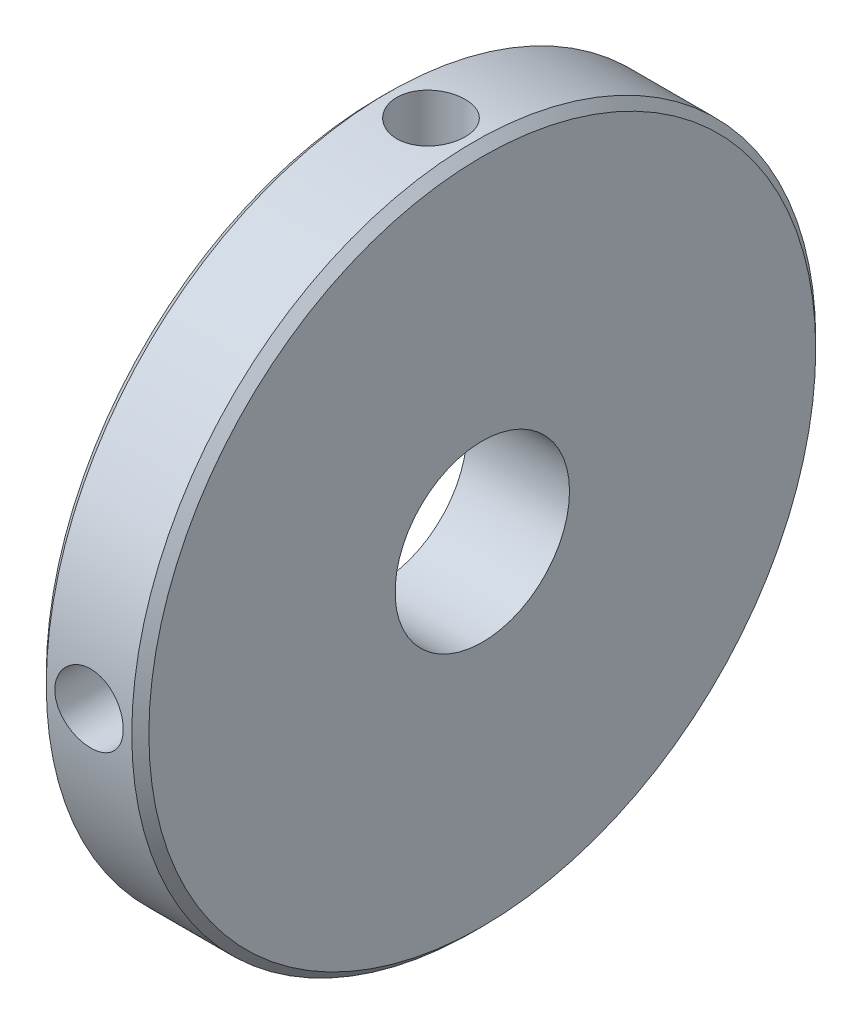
ISO-10303-21;
HEADER;
FILE_DESCRIPTION(('STEP AP214'),'2;1');
FILE_NAME('part.step','',(''),(''),'','','');
FILE_SCHEMA(('AUTOMOTIVE_DESIGN { 1 0 10303 214 1 1 1 1 }'));
ENDSEC;
DATA;
#1=APPLICATION_CONTEXT('core data for automotive mechanical design processes');
#2=APPLICATION_PROTOCOL_DEFINITION('international standard','automotive_design',2000,#1);
#3=PRODUCT_CONTEXT('',#1,'mechanical');
#4=PRODUCT('Part','Part','',(#3));
#5=PRODUCT_RELATED_PRODUCT_CATEGORY('part','',(#4));
#6=PRODUCT_DEFINITION_FORMATION('','',#4);
#7=PRODUCT_DEFINITION_CONTEXT('part definition',#1,'design');
#8=PRODUCT_DEFINITION('design','',#6,#7);
#9=PRODUCT_DEFINITION_SHAPE('','',#8);
#10=(LENGTH_UNIT() NAMED_UNIT(*) SI_UNIT(.MILLI.,.METRE.));
#11=(NAMED_UNIT(*) PLANE_ANGLE_UNIT() SI_UNIT($,.RADIAN.));
#12=(NAMED_UNIT(*) SI_UNIT($,.STERADIAN.) SOLID_ANGLE_UNIT());
#13=UNCERTAINTY_MEASURE_WITH_UNIT(LENGTH_MEASURE(1.E-05),#10,'distance_accuracy_value','');
#14=(GEOMETRIC_REPRESENTATION_CONTEXT(3) GLOBAL_UNCERTAINTY_ASSIGNED_CONTEXT((#13)) GLOBAL_UNIT_ASSIGNED_CONTEXT((#10,
#11,#12)) REPRESENTATION_CONTEXT('',''));
#15=CARTESIAN_POINT('',(0.,0.,0.));
#16=DIRECTION('',(0.,0.,1.));
#17=DIRECTION('',(1.,0.,0.));
#18=AXIS2_PLACEMENT_3D('',#15,#16,#17);
#19=CARTESIAN_POINT('',(-6.22145748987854,0.,0.));
#20=DIRECTION('',(-1.,0.,0.));
#21=DIRECTION('',(0.,0.,1.));
#22=AXIS2_PLACEMENT_3D('',#19,#20,#21);
#23=CYLINDRICAL_SURFACE('',#22,20.);
#24=CARTESIAN_POINT('',(5.5,0.,0.));
#25=DIRECTION('',(-1.,0.,0.));
#26=DIRECTION('',(0.,0.,1.));
#27=AXIS2_PLACEMENT_3D('',#24,#25,#26);
#28=CIRCLE('',#27,20.);
#29=CARTESIAN_POINT('',(5.5,0.,20.));
#30=VERTEX_POINT('',#29);
#31=EDGE_CURVE('E138',#30,#30,#28,.T.);
#32=ORIENTED_EDGE('',*,*,#31,.T.);
#33=EDGE_LOOP('',(#32));
#34=FACE_BOUND('',#33,.T.);
#35=CARTESIAN_POINT('',(0.500000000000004,0.,0.));
#36=DIRECTION('',(1.,0.,0.));
#37=DIRECTION('',(0.,0.,-1.));
#38=AXIS2_PLACEMENT_3D('',#35,#36,#37);
#39=CIRCLE('',#38,20.);
#40=CARTESIAN_POINT('',(0.500000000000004,0.,-20.));
#41=VERTEX_POINT('',#40);
#42=EDGE_CURVE('E139',#41,#41,#39,.T.);
#43=ORIENTED_EDGE('',*,*,#42,.T.);
#44=EDGE_LOOP('',(#43));
#45=FACE_BOUND('',#44,.T.);
#46=CARTESIAN_POINT('',(1.,20.,0.));
#47=CARTESIAN_POINT('',(1.00000485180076,19.9999987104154,0.112040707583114));
#48=CARTESIAN_POINT('',(1.00944653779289,19.9990485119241,0.224155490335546));
#49=CARTESIAN_POINT('',(1.04696874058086,19.9953493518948,0.445276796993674));
#50=CARTESIAN_POINT('',(1.07506979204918,19.9925984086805,0.554279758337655));
#51=CARTESIAN_POINT('',(1.14908448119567,19.9856082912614,0.765943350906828));
#52=CARTESIAN_POINT('',(1.19498736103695,19.9813700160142,0.868607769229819));
#53=CARTESIAN_POINT('',(1.30328181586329,19.9718791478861,1.06475232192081));
#54=CARTESIAN_POINT('',(1.36567011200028,19.9666267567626,1.15823427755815));
#55=CARTESIAN_POINT('',(1.50540539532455,19.9556748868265,1.33371910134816));
#56=CARTESIAN_POINT('',(1.58279959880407,19.9499740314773,1.41568428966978));
#57=CARTESIAN_POINT('',(1.75024906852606,19.9387791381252,1.56548504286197));
#58=CARTESIAN_POINT('',(1.84030492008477,19.9332851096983,1.6333199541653));
#59=CARTESIAN_POINT('',(2.03075706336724,19.9231118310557,1.75306794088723));
#60=CARTESIAN_POINT('',(2.13117488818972,19.9184343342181,1.80494693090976));
#61=CARTESIAN_POINT('',(2.33935117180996,19.9104407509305,1.89109276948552));
#62=CARTESIAN_POINT('',(2.4471094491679,19.9071246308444,1.92536005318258));
#63=CARTESIAN_POINT('',(2.66652360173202,19.9022416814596,1.97519808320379));
#64=CARTESIAN_POINT('',(2.77816515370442,19.9006690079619,1.99083130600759));
#65=CARTESIAN_POINT('',(3.00249772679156,19.8994328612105,2.00315057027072));
#66=CARTESIAN_POINT('',(3.11518872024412,19.8997693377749,1.9998371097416));
#67=CARTESIAN_POINT('',(3.33799061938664,19.9023081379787,1.97440856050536));
#68=CARTESIAN_POINT('',(3.44810939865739,19.904503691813,1.9523616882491));
#69=CARTESIAN_POINT('',(3.66307592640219,19.9105026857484,1.89019828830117));
#70=CARTESIAN_POINT('',(3.76792360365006,19.9143061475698,1.85008151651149));
#71=CARTESIAN_POINT('',(3.96958717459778,19.9231001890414,1.75284178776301));
#72=CARTESIAN_POINT('',(4.06638837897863,19.9280928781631,1.69568856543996));
#73=CARTESIAN_POINT('',(4.24905042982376,19.9387010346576,1.56602005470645));
#74=CARTESIAN_POINT('',(4.33491095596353,19.9443165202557,1.49350431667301));
#75=CARTESIAN_POINT('',(4.49365078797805,19.9555677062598,1.33478822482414));
#76=CARTESIAN_POINT('',(4.56647120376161,19.9612033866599,1.24852895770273));
#77=CARTESIAN_POINT('',(4.69660726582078,19.9718365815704,1.06497896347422));
#78=CARTESIAN_POINT('',(4.75392289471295,19.9768340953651,0.967688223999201));
#79=CARTESIAN_POINT('',(4.8514200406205,19.9856295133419,0.764796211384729));
#80=CARTESIAN_POINT('',(4.89159856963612,19.9894272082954,0.659193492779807));
#81=CARTESIAN_POINT('',(4.9536378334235,19.9953929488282,0.442694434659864));
#82=CARTESIAN_POINT('',(4.97549911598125,19.9975610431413,0.331798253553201));
#83=CARTESIAN_POINT('',(5.00020861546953,20.0000170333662,0.108370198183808));
#84=CARTESIAN_POINT('',(5.003138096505,20.0003129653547,-0.00415260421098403));
#85=CARTESIAN_POINT('',(4.99011427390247,19.9990128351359,-0.228087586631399));
#86=CARTESIAN_POINT('',(4.97416122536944,19.9974167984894,-0.33949978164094));
#87=CARTESIAN_POINT('',(4.92389260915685,19.9925172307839,-0.557816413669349));
#88=CARTESIAN_POINT('',(4.88961509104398,19.9892172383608,-0.664729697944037));
#89=CARTESIAN_POINT('',(4.80370965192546,19.9812799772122,-0.871288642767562));
#90=CARTESIAN_POINT('',(4.7520813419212,19.9766426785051,-0.970934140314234));
#91=CARTESIAN_POINT('',(4.63273832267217,19.9665295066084,-1.16049636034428));
#92=CARTESIAN_POINT('',(4.56497022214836,19.9610508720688,-1.25037931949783));
#93=CARTESIAN_POINT('',(4.41534786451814,19.9498786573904,-1.41752324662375));
#94=CARTESIAN_POINT('',(4.33349325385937,19.9441850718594,-1.49478389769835));
#95=CARTESIAN_POINT('',(4.157666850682,19.9332004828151,-1.63477221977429));
#96=CARTESIAN_POINT('',(4.06365248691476,19.9279110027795,-1.69744655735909));
#97=CARTESIAN_POINT('',(3.86638527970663,19.9183566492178,-1.80611651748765));
#98=CARTESIAN_POINT('',(3.76313256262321,19.9140917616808,-1.85211236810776));
#99=CARTESIAN_POINT('',(3.55050252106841,19.907078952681,-1.92603041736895));
#100=CARTESIAN_POINT('',(3.44113631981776,19.9043283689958,-1.95398434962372));
#101=CARTESIAN_POINT('',(3.21923360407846,19.9006473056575,-1.99112801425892));
#102=CARTESIAN_POINT('',(3.10669718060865,19.8997167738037,-2.00031828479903));
#103=CARTESIAN_POINT('',(2.88217862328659,19.8997822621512,-1.99966627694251));
#104=CARTESIAN_POINT('',(2.77019623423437,19.9007698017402,-1.98990777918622));
#105=CARTESIAN_POINT('',(2.54947016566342,19.9045420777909,-1.9518109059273));
#106=CARTESIAN_POINT('',(2.44072648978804,19.9073268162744,-1.92347250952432));
#107=CARTESIAN_POINT('',(2.22956530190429,19.9143773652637,-1.84904337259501));
#108=CARTESIAN_POINT('',(2.12714691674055,19.9186429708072,-1.80295508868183));
#109=CARTESIAN_POINT('',(1.93148621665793,19.9281750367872,-1.69434310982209));
#110=CARTESIAN_POINT('',(1.83824385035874,19.933441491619,-1.63181950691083));
#111=CARTESIAN_POINT('',(1.66315265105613,19.944409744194,-1.49179711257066));
#112=CARTESIAN_POINT('',(1.58135384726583,19.950113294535,-1.41423589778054));
#113=CARTESIAN_POINT('',(1.43189553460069,19.9612970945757,-1.24646339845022));
#114=CARTESIAN_POINT('',(1.36423941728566,19.9667772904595,-1.15624908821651));
#115=CARTESIAN_POINT('',(1.24485309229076,19.9769112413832,-0.965482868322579));
#116=CARTESIAN_POINT('',(1.19316341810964,19.9815628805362,-0.864905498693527));
#117=CARTESIAN_POINT('',(1.10747515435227,19.9894925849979,-0.656516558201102));
#118=CARTESIAN_POINT('',(1.07345661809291,19.9927721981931,-0.548713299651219));
#119=CARTESIAN_POINT('',(1.0325587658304,19.9967642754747,-0.366916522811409));
#120=CARTESIAN_POINT('',(1.02036591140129,19.9979720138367,-0.294085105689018));
#121=CARTESIAN_POINT('',(1.00408494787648,19.9995902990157,-0.147513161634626));
#122=CARTESIAN_POINT('',(0.999996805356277,20.0000008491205,-0.0737726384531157));
#123=CARTESIAN_POINT('',(1.,20.,0.));
#124=B_SPLINE_CURVE_WITH_KNOTS('',3,(#46,#47,#48,#49,#50,#51,#52,#53,#54,#55,#56,#57,#58,#59,
#60,#61,#62,#63,#64,#65,#66,#67,#68,#69,#70,#71,#72,#73,#74,#75,#76,#77,#78,#79,#80,#81,#82,#83,
#84,#85,#86,#87,#88,#89,#90,#91,#92,#93,#94,#95,#96,#97,#98,#99,#100,#101,#102,#103,#104,#105,
#106,#107,#108,#109,#110,#111,#112,#113,#114,#115,#116,#117,#118,#119,#120,#121,#122,#123),
.UNSPECIFIED.,.T.,.F.,(4,2,2,2,2,2,2,2,2,2,2,2,2,2,2,2,2,2,2,2,2,2,2,2,2,2,2,2,2,2,2,2,2,2,2,2,
2,2,4),(0.,0.335852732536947,0.672075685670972,1.0080957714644,1.34404907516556,
1.68107713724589,2.01812078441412,2.35587950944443,2.69362988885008,3.03024464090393,
3.36685054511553,3.70223594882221,4.03762588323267,4.37361522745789,4.7096144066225,
5.04709468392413,5.38457533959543,5.72211481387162,6.05964419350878,6.39572377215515,
6.73179881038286,7.06717870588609,7.40256612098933,7.73907881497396,8.07559995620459,
8.41333287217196,8.75106116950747,9.08819381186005,9.4253167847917,9.76095258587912,
10.0965887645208,10.432178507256,10.7677663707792,11.1047783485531,11.4418710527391,
11.7798126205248,12.1173718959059,12.338513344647,12.5596538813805),.UNSPECIFIED.);
#125=CARTESIAN_POINT('',(1.,20.,0.));
#126=VERTEX_POINT('',#125);
#127=EDGE_CURVE('E86',#126,#126,#124,.T.);
#128=ORIENTED_EDGE('',*,*,#127,.F.);
#129=EDGE_LOOP('',(#128));
#130=FACE_BOUND('',#129,.T.);
#131=CARTESIAN_POINT('',(1.,0.,-20.));
#132=CARTESIAN_POINT('',(1.00000485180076,0.112040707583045,-19.9999987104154));
#133=CARTESIAN_POINT('',(1.00944653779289,0.224155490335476,-19.9990485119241));
#134=CARTESIAN_POINT('',(1.04696874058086,0.445276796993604,-19.9953493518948));
#135=CARTESIAN_POINT('',(1.07506979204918,0.554279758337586,-19.9925984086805));
#136=CARTESIAN_POINT('',(1.14908448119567,0.765943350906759,-19.9856082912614));
#137=CARTESIAN_POINT('',(1.19498736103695,0.868607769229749,-19.9813700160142));
#138=CARTESIAN_POINT('',(1.30328181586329,1.06475232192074,-19.9718791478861));
#139=CARTESIAN_POINT('',(1.36567011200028,1.15823427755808,-19.9666267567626));
#140=CARTESIAN_POINT('',(1.50540539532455,1.33371910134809,-19.9556748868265));
#141=CARTESIAN_POINT('',(1.58279959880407,1.41568428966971,-19.9499740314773));
#142=CARTESIAN_POINT('',(1.75024906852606,1.5654850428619,-19.9387791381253));
#143=CARTESIAN_POINT('',(1.84030492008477,1.63331995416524,-19.9332851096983));
#144=CARTESIAN_POINT('',(2.03075706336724,1.75306794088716,-19.9231118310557));
#145=CARTESIAN_POINT('',(2.13117488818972,1.80494693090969,-19.9184343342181));
#146=CARTESIAN_POINT('',(2.33935117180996,1.89109276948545,-19.9104407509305));
#147=CARTESIAN_POINT('',(2.4471094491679,1.92536005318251,-19.9071246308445));
#148=CARTESIAN_POINT('',(2.66652360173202,1.97519808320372,-19.9022416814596));
#149=CARTESIAN_POINT('',(2.77816515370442,1.99083130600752,-19.9006690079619));
#150=CARTESIAN_POINT('',(3.00249772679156,2.00315057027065,-19.8994328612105));
#151=CARTESIAN_POINT('',(3.11518872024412,1.99983710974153,-19.8997693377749));
#152=CARTESIAN_POINT('',(3.33799061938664,1.97440856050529,-19.9023081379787));
#153=CARTESIAN_POINT('',(3.44810939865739,1.95236168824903,-19.904503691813));
#154=CARTESIAN_POINT('',(3.66307592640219,1.8901982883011,-19.9105026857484));
#155=CARTESIAN_POINT('',(3.76792360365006,1.85008151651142,-19.9143061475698));
#156=CARTESIAN_POINT('',(3.96958717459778,1.75284178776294,-19.9231001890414));
#157=CARTESIAN_POINT('',(4.06638837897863,1.69568856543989,-19.9280928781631));
#158=CARTESIAN_POINT('',(4.24905042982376,1.56602005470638,-19.9387010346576));
#159=CARTESIAN_POINT('',(4.33491095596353,1.49350431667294,-19.9443165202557));
#160=CARTESIAN_POINT('',(4.49365078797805,1.33478822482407,-19.9555677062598));
#161=CARTESIAN_POINT('',(4.56647120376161,1.24852895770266,-19.96120338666));
#162=CARTESIAN_POINT('',(4.69660726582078,1.06497896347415,-19.9718365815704));
#163=CARTESIAN_POINT('',(4.75392289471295,0.967688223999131,-19.9768340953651));
#164=CARTESIAN_POINT('',(4.8514200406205,0.764796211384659,-19.9856295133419));
#165=CARTESIAN_POINT('',(4.89159856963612,0.659193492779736,-19.9894272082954));
#166=CARTESIAN_POINT('',(4.9536378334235,0.442694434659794,-19.9953929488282));
#167=CARTESIAN_POINT('',(4.97549911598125,0.33179825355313,-19.9975610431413));
#168=CARTESIAN_POINT('',(5.00020861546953,0.108370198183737,-20.0000170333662));
#169=CARTESIAN_POINT('',(5.003138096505,-0.00415260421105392,-20.0003129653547));
#170=CARTESIAN_POINT('',(4.99011427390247,-0.228087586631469,-19.9990128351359));
#171=CARTESIAN_POINT('',(4.97416122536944,-0.33949978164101,-19.9974167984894));
#172=CARTESIAN_POINT('',(4.92389260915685,-0.557816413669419,-19.9925172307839));
#173=CARTESIAN_POINT('',(4.88961509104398,-0.664729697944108,-19.9892172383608));
#174=CARTESIAN_POINT('',(4.80370965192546,-0.871288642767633,-19.9812799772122));
#175=CARTESIAN_POINT('',(4.7520813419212,-0.970934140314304,-19.9766426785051));
#176=CARTESIAN_POINT('',(4.63273832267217,-1.16049636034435,-19.9665295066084));
#177=CARTESIAN_POINT('',(4.56497022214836,-1.2503793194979,-19.9610508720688));
#178=CARTESIAN_POINT('',(4.41534786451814,-1.41752324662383,-19.9498786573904));
#179=CARTESIAN_POINT('',(4.33349325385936,-1.49478389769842,-19.9441850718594));
#180=CARTESIAN_POINT('',(4.157666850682,-1.63477221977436,-19.9332004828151));
#181=CARTESIAN_POINT('',(4.06365248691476,-1.69744655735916,-19.9279110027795));
#182=CARTESIAN_POINT('',(3.86638527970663,-1.80611651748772,-19.9183566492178));
#183=CARTESIAN_POINT('',(3.76313256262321,-1.85211236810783,-19.9140917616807));
#184=CARTESIAN_POINT('',(3.55050252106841,-1.92603041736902,-19.907078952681));
#185=CARTESIAN_POINT('',(3.44113631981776,-1.95398434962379,-19.9043283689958));
#186=CARTESIAN_POINT('',(3.21923360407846,-1.99112801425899,-19.9006473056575));
#187=CARTESIAN_POINT('',(3.10669718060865,-2.0003182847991,-19.8997167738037));
#188=CARTESIAN_POINT('',(2.88217862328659,-1.99966627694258,-19.8997822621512));
#189=CARTESIAN_POINT('',(2.77019623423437,-1.98990777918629,-19.9007698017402));
#190=CARTESIAN_POINT('',(2.54947016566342,-1.95181090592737,-19.9045420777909));
#191=CARTESIAN_POINT('',(2.44072648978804,-1.92347250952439,-19.9073268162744));
#192=CARTESIAN_POINT('',(2.22956530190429,-1.84904337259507,-19.9143773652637));
#193=CARTESIAN_POINT('',(2.12714691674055,-1.8029550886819,-19.9186429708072));
#194=CARTESIAN_POINT('',(1.93148621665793,-1.69434310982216,-19.9281750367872));
#195=CARTESIAN_POINT('',(1.83824385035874,-1.6318195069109,-19.933441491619));
#196=CARTESIAN_POINT('',(1.66315265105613,-1.49179711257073,-19.944409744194));
#197=CARTESIAN_POINT('',(1.58135384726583,-1.41423589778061,-19.950113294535));
#198=CARTESIAN_POINT('',(1.43189553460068,-1.24646339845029,-19.9612970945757));
#199=CARTESIAN_POINT('',(1.36423941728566,-1.15624908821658,-19.9667772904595));
#200=CARTESIAN_POINT('',(1.24485309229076,-0.965482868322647,-19.9769112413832));
#201=CARTESIAN_POINT('',(1.19316341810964,-0.864905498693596,-19.9815628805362));
#202=CARTESIAN_POINT('',(1.10747515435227,-0.65651655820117,-19.9894925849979));
#203=CARTESIAN_POINT('',(1.07345661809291,-0.548713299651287,-19.9927721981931));
#204=CARTESIAN_POINT('',(1.0325587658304,-0.366916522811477,-19.9967642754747));
#205=CARTESIAN_POINT('',(1.02036591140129,-0.294085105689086,-19.9979720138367));
#206=CARTESIAN_POINT('',(1.00408494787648,-0.147513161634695,-19.9995902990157));
#207=CARTESIAN_POINT('',(0.999996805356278,-0.0737726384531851,-20.0000008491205));
#208=CARTESIAN_POINT('',(1.,0.,-20.));
#209=B_SPLINE_CURVE_WITH_KNOTS('',3,(#131,#132,#133,#134,#135,#136,#137,#138,#139,#140,#141,
#142,#143,#144,#145,#146,#147,#148,#149,#150,#151,#152,#153,#154,#155,#156,#157,#158,#159,#160,
#161,#162,#163,#164,#165,#166,#167,#168,#169,#170,#171,#172,#173,#174,#175,#176,#177,#178,#179,
#180,#181,#182,#183,#184,#185,#186,#187,#188,#189,#190,#191,#192,#193,#194,#195,#196,#197,#198,
#199,#200,#201,#202,#203,#204,#205,#206,#207,#208),.UNSPECIFIED.,.T.,.F.,(4,2,2,2,2,2,2,2,2,2,2,
2,2,2,2,2,2,2,2,2,2,2,2,2,2,2,2,2,2,2,2,2,2,2,2,2,2,2,4),(0.,0.335852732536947,
0.672075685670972,1.0080957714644,1.34404907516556,1.68107713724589,2.01812078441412,
2.35587950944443,2.69362988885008,3.03024464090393,3.36685054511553,3.70223594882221,
4.03762588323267,4.37361522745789,4.7096144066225,5.04709468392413,5.38457533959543,
5.72211481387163,6.05964419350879,6.39572377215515,6.73179881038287,7.06717870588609,
7.40256612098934,7.73907881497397,8.0755999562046,8.41333287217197,8.75106116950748,
9.08819381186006,9.4253167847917,9.76095258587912,10.0965887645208,10.432178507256,
10.7677663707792,11.1047783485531,11.4418710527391,11.7798126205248,12.1173718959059,
12.338513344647,12.5596538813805),.UNSPECIFIED.);
#210=CARTESIAN_POINT('',(1.,0.,-20.));
#211=VERTEX_POINT('',#210);
#212=EDGE_CURVE('E93',#211,#211,#209,.T.);
#213=ORIENTED_EDGE('',*,*,#212,.F.);
#214=EDGE_LOOP('',(#213));
#215=FACE_BOUND('',#214,.T.);
#216=CARTESIAN_POINT('',(1.,-20.,1.39659334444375E-13));
#217=CARTESIAN_POINT('',(1.00000485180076,-19.9999987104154,-0.112040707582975));
#218=CARTESIAN_POINT('',(1.00944653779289,-19.9990485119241,-0.224155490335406));
#219=CARTESIAN_POINT('',(1.04696874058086,-19.9953493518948,-0.445276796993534));
#220=CARTESIAN_POINT('',(1.07506979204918,-19.9925984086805,-0.554279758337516));
#221=CARTESIAN_POINT('',(1.14908448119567,-19.9856082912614,-0.765943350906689));
#222=CARTESIAN_POINT('',(1.19498736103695,-19.9813700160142,-0.868607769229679));
#223=CARTESIAN_POINT('',(1.30328181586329,-19.9718791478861,-1.06475232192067));
#224=CARTESIAN_POINT('',(1.36567011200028,-19.9666267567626,-1.15823427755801));
#225=CARTESIAN_POINT('',(1.50540539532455,-19.9556748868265,-1.33371910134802));
#226=CARTESIAN_POINT('',(1.58279959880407,-19.9499740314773,-1.41568428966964));
#227=CARTESIAN_POINT('',(1.75024906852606,-19.9387791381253,-1.56548504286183));
#228=CARTESIAN_POINT('',(1.84030492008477,-19.9332851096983,-1.63331995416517));
#229=CARTESIAN_POINT('',(2.03075706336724,-19.9231118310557,-1.75306794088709));
#230=CARTESIAN_POINT('',(2.13117488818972,-19.9184343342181,-1.80494693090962));
#231=CARTESIAN_POINT('',(2.33935117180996,-19.9104407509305,-1.89109276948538));
#232=CARTESIAN_POINT('',(2.4471094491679,-19.9071246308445,-1.92536005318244));
#233=CARTESIAN_POINT('',(2.66652360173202,-19.9022416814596,-1.97519808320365));
#234=CARTESIAN_POINT('',(2.77816515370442,-19.9006690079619,-1.99083130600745));
#235=CARTESIAN_POINT('',(3.00249772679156,-19.8994328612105,-2.00315057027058));
#236=CARTESIAN_POINT('',(3.11518872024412,-19.8997693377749,-1.99983710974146));
#237=CARTESIAN_POINT('',(3.33799061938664,-19.9023081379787,-1.97440856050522));
#238=CARTESIAN_POINT('',(3.44810939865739,-19.904503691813,-1.95236168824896));
#239=CARTESIAN_POINT('',(3.66307592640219,-19.9105026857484,-1.89019828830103));
#240=CARTESIAN_POINT('',(3.76792360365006,-19.9143061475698,-1.85008151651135));
#241=CARTESIAN_POINT('',(3.96958717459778,-19.9231001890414,-1.75284178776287));
#242=CARTESIAN_POINT('',(4.06638837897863,-19.9280928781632,-1.69568856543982));
#243=CARTESIAN_POINT('',(4.24905042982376,-19.9387010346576,-1.56602005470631));
#244=CARTESIAN_POINT('',(4.33491095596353,-19.9443165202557,-1.49350431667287));
#245=CARTESIAN_POINT('',(4.49365078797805,-19.9555677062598,-1.334788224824));
#246=CARTESIAN_POINT('',(4.56647120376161,-19.96120338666,-1.24852895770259));
#247=CARTESIAN_POINT('',(4.69660726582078,-19.9718365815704,-1.06497896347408));
#248=CARTESIAN_POINT('',(4.75392289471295,-19.9768340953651,-0.967688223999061));
#249=CARTESIAN_POINT('',(4.85142004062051,-19.9856295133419,-0.764796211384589));
#250=CARTESIAN_POINT('',(4.89159856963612,-19.9894272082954,-0.659193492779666));
#251=CARTESIAN_POINT('',(4.9536378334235,-19.9953929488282,-0.442694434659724));
#252=CARTESIAN_POINT('',(4.97549911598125,-19.9975610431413,-0.33179825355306));
#253=CARTESIAN_POINT('',(5.00020861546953,-20.0000170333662,-0.108370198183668));
#254=CARTESIAN_POINT('',(5.003138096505,-20.0003129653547,0.00415260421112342));
#255=CARTESIAN_POINT('',(4.99011427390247,-19.9990128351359,0.228087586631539));
#256=CARTESIAN_POINT('',(4.97416122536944,-19.9974167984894,0.339499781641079));
#257=CARTESIAN_POINT('',(4.92389260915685,-19.9925172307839,0.557816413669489));
#258=CARTESIAN_POINT('',(4.88961509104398,-19.9892172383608,0.664729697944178));
#259=CARTESIAN_POINT('',(4.80370965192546,-19.9812799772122,0.871288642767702));
#260=CARTESIAN_POINT('',(4.7520813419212,-19.9766426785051,0.970934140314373));
#261=CARTESIAN_POINT('',(4.63273832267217,-19.9665295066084,1.16049636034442));
#262=CARTESIAN_POINT('',(4.56497022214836,-19.9610508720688,1.25037931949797));
#263=CARTESIAN_POINT('',(4.41534786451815,-19.9498786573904,1.4175232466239));
#264=CARTESIAN_POINT('',(4.33349325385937,-19.9441850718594,1.49478389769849));
#265=CARTESIAN_POINT('',(4.157666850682,-19.9332004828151,1.63477221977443));
#266=CARTESIAN_POINT('',(4.06365248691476,-19.9279110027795,1.69744655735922));
#267=CARTESIAN_POINT('',(3.86638527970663,-19.9183566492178,1.80611651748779));
#268=CARTESIAN_POINT('',(3.76313256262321,-19.9140917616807,1.8521123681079));
#269=CARTESIAN_POINT('',(3.55050252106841,-19.907078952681,1.92603041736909));
#270=CARTESIAN_POINT('',(3.44113631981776,-19.9043283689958,1.95398434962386));
#271=CARTESIAN_POINT('',(3.21923360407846,-19.9006473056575,1.99112801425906));
#272=CARTESIAN_POINT('',(3.10669718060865,-19.8997167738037,2.00031828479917));
#273=CARTESIAN_POINT('',(2.88217862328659,-19.8997822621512,1.99966627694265));
#274=CARTESIAN_POINT('',(2.77019623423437,-19.9007698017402,1.98990777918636));
#275=CARTESIAN_POINT('',(2.54947016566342,-19.9045420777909,1.95181090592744));
#276=CARTESIAN_POINT('',(2.44072648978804,-19.9073268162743,1.92347250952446));
#277=CARTESIAN_POINT('',(2.22956530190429,-19.9143773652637,1.84904337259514));
#278=CARTESIAN_POINT('',(2.12714691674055,-19.9186429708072,1.80295508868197));
#279=CARTESIAN_POINT('',(1.93148621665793,-19.9281750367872,1.69434310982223));
#280=CARTESIAN_POINT('',(1.83824385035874,-19.933441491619,1.63181950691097));
#281=CARTESIAN_POINT('',(1.66315265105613,-19.9444097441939,1.4917971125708));
#282=CARTESIAN_POINT('',(1.58135384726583,-19.950113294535,1.41423589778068));
#283=CARTESIAN_POINT('',(1.43189553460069,-19.9612970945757,1.24646339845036));
#284=CARTESIAN_POINT('',(1.36423941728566,-19.9667772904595,1.15624908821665));
#285=CARTESIAN_POINT('',(1.24485309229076,-19.9769112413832,0.965482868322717));
#286=CARTESIAN_POINT('',(1.19316341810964,-19.9815628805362,0.864905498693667));
#287=CARTESIAN_POINT('',(1.10747515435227,-19.9894925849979,0.656516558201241));
#288=CARTESIAN_POINT('',(1.07345661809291,-19.9927721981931,0.548713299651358));
#289=CARTESIAN_POINT('',(1.0325587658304,-19.9967642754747,0.366916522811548));
#290=CARTESIAN_POINT('',(1.02036591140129,-19.9979720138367,0.294085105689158));
#291=CARTESIAN_POINT('',(1.00408494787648,-19.9995902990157,0.147513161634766));
#292=CARTESIAN_POINT('',(0.999996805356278,-20.0000008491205,0.0737726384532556));
#293=CARTESIAN_POINT('',(1.,-20.,1.39659334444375E-13));
#294=B_SPLINE_CURVE_WITH_KNOTS('',3,(#216,#217,#218,#219,#220,#221,#222,#223,#224,#225,#226,
#227,#228,#229,#230,#231,#232,#233,#234,#235,#236,#237,#238,#239,#240,#241,#242,#243,#244,#245,
#246,#247,#248,#249,#250,#251,#252,#253,#254,#255,#256,#257,#258,#259,#260,#261,#262,#263,#264,
#265,#266,#267,#268,#269,#270,#271,#272,#273,#274,#275,#276,#277,#278,#279,#280,#281,#282,#283,
#284,#285,#286,#287,#288,#289,#290,#291,#292,#293),.UNSPECIFIED.,.T.,.F.,(4,2,2,2,2,2,2,2,2,2,2,
2,2,2,2,2,2,2,2,2,2,2,2,2,2,2,2,2,2,2,2,2,2,2,2,2,2,2,4),(0.,0.335852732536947,
0.672075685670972,1.0080957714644,1.34404907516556,1.68107713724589,2.01812078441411,
2.35587950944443,2.69362988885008,3.03024464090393,3.36685054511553,3.70223594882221,
4.03762588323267,4.37361522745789,4.70961440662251,5.04709468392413,5.38457533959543,
5.72211481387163,6.05964419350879,6.39572377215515,6.73179881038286,7.06717870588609,
7.40256612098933,7.73907881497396,8.07559995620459,8.41333287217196,8.75106116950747,
9.08819381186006,9.4253167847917,9.76095258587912,10.0965887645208,10.432178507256,
10.7677663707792,11.1047783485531,11.4418710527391,11.7798126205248,12.1173718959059,
12.338513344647,12.5596538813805),.UNSPECIFIED.);
#295=CARTESIAN_POINT('',(1.,-20.,1.39659334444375E-13));
#296=VERTEX_POINT('',#295);
#297=EDGE_CURVE('E43',#296,#296,#294,.T.);
#298=ORIENTED_EDGE('',*,*,#297,.F.);
#299=EDGE_LOOP('',(#298));
#300=FACE_BOUND('',#299,.T.);
#301=CARTESIAN_POINT('',(1.,2.09489001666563E-13,20.));
#302=CARTESIAN_POINT('',(1.00000485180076,-0.112040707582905,19.9999987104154));
#303=CARTESIAN_POINT('',(1.00944653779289,-0.224155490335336,19.9990485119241));
#304=CARTESIAN_POINT('',(1.04696874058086,-0.445276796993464,19.9953493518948));
#305=CARTESIAN_POINT('',(1.07506979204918,-0.554279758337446,19.9925984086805));
#306=CARTESIAN_POINT('',(1.14908448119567,-0.765943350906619,19.9856082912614));
#307=CARTESIAN_POINT('',(1.19498736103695,-0.868607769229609,19.9813700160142));
#308=CARTESIAN_POINT('',(1.30328181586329,-1.0647523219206,19.9718791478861));
#309=CARTESIAN_POINT('',(1.36567011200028,-1.15823427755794,19.9666267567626));
#310=CARTESIAN_POINT('',(1.50540539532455,-1.33371910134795,19.9556748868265));
#311=CARTESIAN_POINT('',(1.58279959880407,-1.41568428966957,19.9499740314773));
#312=CARTESIAN_POINT('',(1.75024906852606,-1.56548504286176,19.9387791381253));
#313=CARTESIAN_POINT('',(1.84030492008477,-1.6333199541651,19.9332851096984));
#314=CARTESIAN_POINT('',(2.03075706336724,-1.75306794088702,19.9231118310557));
#315=CARTESIAN_POINT('',(2.13117488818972,-1.80494693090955,19.9184343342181));
#316=CARTESIAN_POINT('',(2.33935117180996,-1.89109276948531,19.9104407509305));
#317=CARTESIAN_POINT('',(2.4471094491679,-1.92536005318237,19.9071246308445));
#318=CARTESIAN_POINT('',(2.66652360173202,-1.97519808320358,19.9022416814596));
#319=CARTESIAN_POINT('',(2.77816515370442,-1.99083130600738,19.9006690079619));
#320=CARTESIAN_POINT('',(3.00249772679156,-2.00315057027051,19.8994328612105));
#321=CARTESIAN_POINT('',(3.11518872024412,-1.99983710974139,19.8997693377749));
#322=CARTESIAN_POINT('',(3.33799061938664,-1.97440856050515,19.9023081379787));
#323=CARTESIAN_POINT('',(3.44810939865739,-1.95236168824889,19.904503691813));
#324=CARTESIAN_POINT('',(3.66307592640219,-1.89019828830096,19.9105026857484));
#325=CARTESIAN_POINT('',(3.76792360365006,-1.85008151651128,19.9143061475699));
#326=CARTESIAN_POINT('',(3.96958717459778,-1.7528417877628,19.9231001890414));
#327=CARTESIAN_POINT('',(4.06638837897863,-1.69568856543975,19.9280928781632));
#328=CARTESIAN_POINT('',(4.24905042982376,-1.56602005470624,19.9387010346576));
#329=CARTESIAN_POINT('',(4.33491095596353,-1.4935043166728,19.9443165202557));
#330=CARTESIAN_POINT('',(4.49365078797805,-1.33478822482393,19.9555677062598));
#331=CARTESIAN_POINT('',(4.56647120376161,-1.24852895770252,19.96120338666));
#332=CARTESIAN_POINT('',(4.69660726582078,-1.06497896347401,19.9718365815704));
#333=CARTESIAN_POINT('',(4.75392289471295,-0.967688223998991,19.9768340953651));
#334=CARTESIAN_POINT('',(4.85142004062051,-0.764796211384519,19.9856295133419));
#335=CARTESIAN_POINT('',(4.89159856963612,-0.659193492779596,19.9894272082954));
#336=CARTESIAN_POINT('',(4.9536378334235,-0.442694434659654,19.9953929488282));
#337=CARTESIAN_POINT('',(4.97549911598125,-0.33179825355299,19.9975610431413));
#338=CARTESIAN_POINT('',(5.00020861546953,-0.108370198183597,20.0000170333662));
#339=CARTESIAN_POINT('',(5.003138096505,0.00415260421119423,20.0003129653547));
#340=CARTESIAN_POINT('',(4.99011427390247,0.22808758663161,19.9990128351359));
#341=CARTESIAN_POINT('',(4.97416122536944,0.33949978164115,19.9974167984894));
#342=CARTESIAN_POINT('',(4.92389260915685,0.557816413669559,19.9925172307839));
#343=CARTESIAN_POINT('',(4.88961509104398,0.664729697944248,19.9892172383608));
#344=CARTESIAN_POINT('',(4.80370965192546,0.871288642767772,19.9812799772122));
#345=CARTESIAN_POINT('',(4.7520813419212,0.970934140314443,19.9766426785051));
#346=CARTESIAN_POINT('',(4.63273832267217,1.16049636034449,19.9665295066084));
#347=CARTESIAN_POINT('',(4.56497022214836,1.25037931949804,19.9610508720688));
#348=CARTESIAN_POINT('',(4.41534786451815,1.41752324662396,19.9498786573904));
#349=CARTESIAN_POINT('',(4.33349325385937,1.49478389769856,19.9441850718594));
#350=CARTESIAN_POINT('',(4.157666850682,1.6347722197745,19.9332004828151));
#351=CARTESIAN_POINT('',(4.06365248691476,1.69744655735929,19.9279110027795));
#352=CARTESIAN_POINT('',(3.86638527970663,1.80611651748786,19.9183566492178));
#353=CARTESIAN_POINT('',(3.76313256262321,1.85211236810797,19.9140917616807));
#354=CARTESIAN_POINT('',(3.55050252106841,1.92603041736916,19.907078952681));
#355=CARTESIAN_POINT('',(3.44113631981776,1.95398434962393,19.9043283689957));
#356=CARTESIAN_POINT('',(3.21923360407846,1.99112801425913,19.9006473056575));
#357=CARTESIAN_POINT('',(3.10669718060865,2.00031828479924,19.8997167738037));
#358=CARTESIAN_POINT('',(2.88217862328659,1.99966627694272,19.8997822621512));
#359=CARTESIAN_POINT('',(2.77019623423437,1.98990777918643,19.9007698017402));
#360=CARTESIAN_POINT('',(2.54947016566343,1.95181090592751,19.9045420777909));
#361=CARTESIAN_POINT('',(2.44072648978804,1.92347250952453,19.9073268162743));
#362=CARTESIAN_POINT('',(2.22956530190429,1.84904337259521,19.9143773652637));
#363=CARTESIAN_POINT('',(2.12714691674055,1.80295508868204,19.9186429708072));
#364=CARTESIAN_POINT('',(1.93148621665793,1.69434310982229,19.9281750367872));
#365=CARTESIAN_POINT('',(1.83824385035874,1.63181950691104,19.933441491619));
#366=CARTESIAN_POINT('',(1.66315265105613,1.49179711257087,19.9444097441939));
#367=CARTESIAN_POINT('',(1.58135384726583,1.41423589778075,19.950113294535));
#368=CARTESIAN_POINT('',(1.43189553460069,1.24646339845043,19.9612970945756));
#369=CARTESIAN_POINT('',(1.36423941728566,1.15624908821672,19.9667772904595));
#370=CARTESIAN_POINT('',(1.24485309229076,0.965482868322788,19.9769112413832));
#371=CARTESIAN_POINT('',(1.19316341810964,0.864905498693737,19.9815628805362));
#372=CARTESIAN_POINT('',(1.10747515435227,0.656516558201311,19.9894925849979));
#373=CARTESIAN_POINT('',(1.07345661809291,0.548713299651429,19.9927721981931));
#374=CARTESIAN_POINT('',(1.0325587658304,0.366916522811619,19.9967642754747));
#375=CARTESIAN_POINT('',(1.02036591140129,0.294085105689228,19.9979720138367));
#376=CARTESIAN_POINT('',(1.00408494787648,0.147513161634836,19.9995902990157));
#377=CARTESIAN_POINT('',(0.999996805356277,0.0737726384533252,20.0000008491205));
#378=CARTESIAN_POINT('',(1.,2.09489001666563E-13,20.));
#379=B_SPLINE_CURVE_WITH_KNOTS('',3,(#301,#302,#303,#304,#305,#306,#307,#308,#309,#310,#311,
#312,#313,#314,#315,#316,#317,#318,#319,#320,#321,#322,#323,#324,#325,#326,#327,#328,#329,#330,
#331,#332,#333,#334,#335,#336,#337,#338,#339,#340,#341,#342,#343,#344,#345,#346,#347,#348,#349,
#350,#351,#352,#353,#354,#355,#356,#357,#358,#359,#360,#361,#362,#363,#364,#365,#366,#367,#368,
#369,#370,#371,#372,#373,#374,#375,#376,#377,#378),.UNSPECIFIED.,.T.,.F.,(4,2,2,2,2,2,2,2,2,2,2,
2,2,2,2,2,2,2,2,2,2,2,2,2,2,2,2,2,2,2,2,2,2,2,2,2,2,2,4),(0.,0.335852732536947,
0.672075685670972,1.0080957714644,1.34404907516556,1.68107713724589,2.01812078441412,
2.35587950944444,2.69362988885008,3.03024464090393,3.36685054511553,3.70223594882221,
4.03762588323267,4.37361522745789,4.7096144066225,5.04709468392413,5.38457533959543,
5.72211481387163,6.05964419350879,6.39572377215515,6.73179881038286,7.06717870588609,
7.40256612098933,7.73907881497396,8.07559995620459,8.41333287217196,8.75106116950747,
9.08819381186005,9.4253167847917,9.76095258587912,10.0965887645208,10.432178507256,
10.7677663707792,11.1047783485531,11.4418710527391,11.7798126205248,12.1173718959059,
12.338513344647,12.5596538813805),.UNSPECIFIED.);
#380=CARTESIAN_POINT('',(1.,2.09489001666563E-13,20.));
#381=VERTEX_POINT('',#380);
#382=EDGE_CURVE('E11',#381,#381,#379,.T.);
#383=ORIENTED_EDGE('',*,*,#382,.F.);
#384=EDGE_LOOP('',(#383));
#385=FACE_BOUND('',#384,.T.);
#386=ADVANCED_FACE('F32',(#34,#45,#130,#215,#300,#385),#23,.T.);
#387=CARTESIAN_POINT('',(0.,0.,0.));
#388=DIRECTION('',(1.,0.,0.));
#389=DIRECTION('',(0.,0.,-1.));
#390=AXIS2_PLACEMENT_3D('',#387,#388,#389);
#391=PLANE('',#390);
#392=CARTESIAN_POINT('',(0.,0.,0.));
#393=DIRECTION('',(1.,0.,0.));
#394=DIRECTION('',(0.,0.,-1.));
#395=AXIS2_PLACEMENT_3D('',#392,#393,#394);
#396=CIRCLE('',#395,5.1);
#397=CARTESIAN_POINT('',(0.,0.,-5.1));
#398=VERTEX_POINT('',#397);
#399=EDGE_CURVE('E175',#398,#398,#396,.T.);
#400=ORIENTED_EDGE('',*,*,#399,.T.);
#401=EDGE_LOOP('',(#400));
#402=FACE_BOUND('',#401,.T.);
#403=CARTESIAN_POINT('',(0.,0.,0.));
#404=DIRECTION('',(1.,0.,0.));
#405=DIRECTION('',(0.,0.,-1.));
#406=AXIS2_PLACEMENT_3D('',#403,#404,#405);
#407=CIRCLE('',#406,19.5);
#408=CARTESIAN_POINT('',(0.,0.,-19.5));
#409=VERTEX_POINT('',#408);
#410=EDGE_CURVE('E141',#409,#409,#407,.F.);
#411=ORIENTED_EDGE('',*,*,#410,.T.);
#412=EDGE_LOOP('',(#411));
#413=FACE_BOUND('',#412,.T.);
#414=ADVANCED_FACE('F34',(#402,#413),#391,.F.);
#415=CARTESIAN_POINT('',(6.,0.,0.));
#416=DIRECTION('',(-1.,0.,0.));
#417=DIRECTION('',(0.,0.,1.));
#418=AXIS2_PLACEMENT_3D('',#415,#416,#417);
#419=PLANE('',#418);
#420=CARTESIAN_POINT('',(6.,0.,0.));
#421=DIRECTION('',(1.,0.,0.));
#422=DIRECTION('',(0.,0.,-1.));
#423=AXIS2_PLACEMENT_3D('',#420,#421,#422);
#424=CIRCLE('',#423,5.09999999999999);
#425=CARTESIAN_POINT('',(6.,0.,-5.09999999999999));
#426=VERTEX_POINT('',#425);
#427=EDGE_CURVE('E178',#426,#426,#424,.T.);
#428=ORIENTED_EDGE('',*,*,#427,.F.);
#429=EDGE_LOOP('',(#428));
#430=FACE_BOUND('',#429,.T.);
#431=CARTESIAN_POINT('',(6.,0.,0.));
#432=DIRECTION('',(-1.,0.,0.));
#433=DIRECTION('',(0.,0.,1.));
#434=AXIS2_PLACEMENT_3D('',#431,#432,#433);
#435=CIRCLE('',#434,19.5);
#436=CARTESIAN_POINT('',(6.,0.,19.5));
#437=VERTEX_POINT('',#436);
#438=EDGE_CURVE('E136',#437,#437,#435,.F.);
#439=ORIENTED_EDGE('',*,*,#438,.T.);
#440=EDGE_LOOP('',(#439));
#441=FACE_BOUND('',#440,.T.);
#442=ADVANCED_FACE('F76',(#430,#441),#419,.F.);
#443=CARTESIAN_POINT('',(5.5,0.,0.));
#444=DIRECTION('',(-1.,0.,0.));
#445=DIRECTION('',(0.,0.,1.));
#446=AXIS2_PLACEMENT_3D('',#443,#444,#445);
#447=CONICAL_SURFACE('',#446,20.,0.785398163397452);
#448=ORIENTED_EDGE('',*,*,#438,.F.);
#449=EDGE_LOOP('',(#448));
#450=FACE_BOUND('',#449,.T.);
#451=ORIENTED_EDGE('',*,*,#31,.F.);
#452=EDGE_LOOP('',(#451));
#453=FACE_BOUND('',#452,.T.);
#454=ADVANCED_FACE('F125',(#450,#453),#447,.T.);
#455=CARTESIAN_POINT('',(0.,0.,0.));
#456=DIRECTION('',(1.,0.,0.));
#457=DIRECTION('',(0.,0.,-1.));
#458=AXIS2_PLACEMENT_3D('',#455,#456,#457);
#459=CONICAL_SURFACE('',#458,19.5,0.785398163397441);
#460=ORIENTED_EDGE('',*,*,#42,.F.);
#461=EDGE_LOOP('',(#460));
#462=FACE_BOUND('',#461,.T.);
#463=ORIENTED_EDGE('',*,*,#410,.F.);
#464=EDGE_LOOP('',(#463));
#465=FACE_BOUND('',#464,.T.);
#466=ADVANCED_FACE('F122',(#462,#465),#459,.T.);
#467=CARTESIAN_POINT('',(3.,20.,0.));
#468=DIRECTION('',(0.,1.,0.));
#469=DIRECTION('',(-1.,0.,0.));
#470=AXIS2_PLACEMENT_3D('',#467,#468,#469);
#471=CYLINDRICAL_SURFACE('',#470,2.);
#472=CARTESIAN_POINT('',(3.,15.,0.));
#473=DIRECTION('',(0.,1.,0.));
#474=DIRECTION('',(-1.,0.,0.));
#475=AXIS2_PLACEMENT_3D('',#472,#473,#474);
#476=CIRCLE('',#475,2.);
#477=CARTESIAN_POINT('',(1.,15.,0.));
#478=VERTEX_POINT('',#477);
#479=EDGE_CURVE('E144',#478,#478,#476,.T.);
#480=ORIENTED_EDGE('',*,*,#479,.F.);
#481=EDGE_LOOP('',(#480));
#482=FACE_BOUND('',#481,.T.);
#483=ORIENTED_EDGE('',*,*,#127,.T.);
#484=EDGE_LOOP('',(#483));
#485=FACE_BOUND('',#484,.T.);
#486=ADVANCED_FACE('F117',(#482,#485),#471,.F.);
#487=CARTESIAN_POINT('',(3.,13.7982787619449,0.));
#488=DIRECTION('',(0.,1.,0.));
#489=DIRECTION('',(-1.,0.,0.));
#490=AXIS2_PLACEMENT_3D('',#487,#488,#489);
#491=CONICAL_SURFACE('',#490,0.,1.02974425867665);
#492=ORIENTED_EDGE('',*,*,#479,.T.);
#493=EDGE_LOOP('',(#492));
#494=FACE_BOUND('',#493,.T.);
#495=CARTESIAN_POINT('',(3.,13.7982787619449,0.));
#496=VERTEX_POINT('',#495);
#497=VERTEX_LOOP('',#496);
#498=FACE_BOUND('',#497,.T.);
#499=ADVANCED_FACE('F114',(#494,#498),#491,.F.);
#500=CARTESIAN_POINT('',(3.,0.,-20.));
#501=DIRECTION('',(0.,0.,-1.));
#502=DIRECTION('',(-1.,0.,0.));
#503=AXIS2_PLACEMENT_3D('',#500,#501,#502);
#504=CYLINDRICAL_SURFACE('',#503,2.);
#505=CARTESIAN_POINT('',(3.,0.,-15.));
#506=DIRECTION('',(0.,0.,-1.));
#507=DIRECTION('',(-1.,0.,0.));
#508=AXIS2_PLACEMENT_3D('',#505,#506,#507);
#509=CIRCLE('',#508,2.);
#510=CARTESIAN_POINT('',(1.,0.,-15.));
#511=VERTEX_POINT('',#510);
#512=EDGE_CURVE('E167',#511,#511,#509,.T.);
#513=ORIENTED_EDGE('',*,*,#512,.F.);
#514=EDGE_LOOP('',(#513));
#515=FACE_BOUND('',#514,.T.);
#516=ORIENTED_EDGE('',*,*,#212,.T.);
#517=EDGE_LOOP('',(#516));
#518=FACE_BOUND('',#517,.T.);
#519=ADVANCED_FACE('F109',(#515,#518),#504,.F.);
#520=CARTESIAN_POINT('',(3.,0.,-13.7982787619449));
#521=DIRECTION('',(0.,0.,-1.));
#522=DIRECTION('',(-1.,0.,0.));
#523=AXIS2_PLACEMENT_3D('',#520,#521,#522);
#524=CONICAL_SURFACE('',#523,0.,1.02974425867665);
#525=ORIENTED_EDGE('',*,*,#512,.T.);
#526=EDGE_LOOP('',(#525));
#527=FACE_BOUND('',#526,.T.);
#528=CARTESIAN_POINT('',(3.,0.,-13.7982787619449));
#529=VERTEX_POINT('',#528);
#530=VERTEX_LOOP('',#529);
#531=FACE_BOUND('',#530,.T.);
#532=ADVANCED_FACE('F106',(#527,#531),#524,.F.);
#533=CARTESIAN_POINT('',(3.,-20.,1.39659334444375E-13));
#534=DIRECTION('',(0.,-1.,0.));
#535=DIRECTION('',(-1.,0.,0.));
#536=AXIS2_PLACEMENT_3D('',#533,#534,#535);
#537=CYLINDRICAL_SURFACE('',#536,2.);
#538=CARTESIAN_POINT('',(3.,-15.,1.04744500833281E-13));
#539=DIRECTION('',(0.,-1.,0.));
#540=DIRECTION('',(-1.,0.,0.));
#541=AXIS2_PLACEMENT_3D('',#538,#539,#540);
#542=CIRCLE('',#541,2.);
#543=CARTESIAN_POINT('',(1.,-15.,1.04744500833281E-13));
#544=VERTEX_POINT('',#543);
#545=EDGE_CURVE('E170',#544,#544,#542,.T.);
#546=ORIENTED_EDGE('',*,*,#545,.F.);
#547=EDGE_LOOP('',(#546));
#548=FACE_BOUND('',#547,.T.);
#549=ORIENTED_EDGE('',*,*,#297,.T.);
#550=EDGE_LOOP('',(#549));
#551=FACE_BOUND('',#550,.T.);
#552=ADVANCED_FACE('F101',(#548,#551),#537,.F.);
#553=CARTESIAN_POINT('',(3.,-13.7982787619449,0.));
#554=DIRECTION('',(0.,-1.,0.));
#555=DIRECTION('',(-1.,0.,0.));
#556=AXIS2_PLACEMENT_3D('',#553,#554,#555);
#557=CONICAL_SURFACE('',#556,0.,1.02974425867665);
#558=ORIENTED_EDGE('',*,*,#545,.T.);
#559=EDGE_LOOP('',(#558));
#560=FACE_BOUND('',#559,.T.);
#561=CARTESIAN_POINT('',(3.,-13.7982787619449,0.));
#562=VERTEX_POINT('',#561);
#563=VERTEX_LOOP('',#562);
#564=FACE_BOUND('',#563,.T.);
#565=ADVANCED_FACE('F68',(#560,#564),#557,.F.);
#566=CARTESIAN_POINT('',(3.,2.09489001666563E-13,20.));
#567=DIRECTION('',(0.,0.,1.));
#568=DIRECTION('',(-1.,0.,0.));
#569=AXIS2_PLACEMENT_3D('',#566,#567,#568);
#570=CYLINDRICAL_SURFACE('',#569,2.);
#571=CARTESIAN_POINT('',(3.,1.57116751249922E-13,15.));
#572=DIRECTION('',(0.,0.,1.));
#573=DIRECTION('',(-1.,0.,0.));
#574=AXIS2_PLACEMENT_3D('',#571,#572,#573);
#575=CIRCLE('',#574,2.);
#576=CARTESIAN_POINT('',(1.,1.57116751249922E-13,15.));
#577=VERTEX_POINT('',#576);
#578=EDGE_CURVE('E173',#577,#577,#575,.T.);
#579=ORIENTED_EDGE('',*,*,#578,.F.);
#580=EDGE_LOOP('',(#579));
#581=FACE_BOUND('',#580,.T.);
#582=ORIENTED_EDGE('',*,*,#382,.T.);
#583=EDGE_LOOP('',(#582));
#584=FACE_BOUND('',#583,.T.);
#585=ADVANCED_FACE('F59',(#581,#584),#570,.F.);
#586=CARTESIAN_POINT('',(3.,1.44529382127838E-13,13.7982787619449));
#587=DIRECTION('',(0.,0.,1.));
#588=DIRECTION('',(-1.,0.,0.));
#589=AXIS2_PLACEMENT_3D('',#586,#587,#588);
#590=CONICAL_SURFACE('',#589,0.,1.02974425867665);
#591=ORIENTED_EDGE('',*,*,#578,.T.);
#592=EDGE_LOOP('',(#591));
#593=FACE_BOUND('',#592,.T.);
#594=CARTESIAN_POINT('',(3.,1.44529382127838E-13,13.7982787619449));
#595=VERTEX_POINT('',#594);
#596=VERTEX_LOOP('',#595);
#597=FACE_BOUND('',#596,.T.);
#598=ADVANCED_FACE('F56',(#593,#597),#590,.F.);
#599=CARTESIAN_POINT('',(6.,0.,0.));
#600=DIRECTION('',(1.,0.,0.));
#601=DIRECTION('',(0.,0.,-1.));
#602=AXIS2_PLACEMENT_3D('',#599,#600,#601);
#603=CYLINDRICAL_SURFACE('',#602,5.09999999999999);
#604=ORIENTED_EDGE('',*,*,#399,.F.);
#605=EDGE_LOOP('',(#604));
#606=FACE_BOUND('',#605,.T.);
#607=ORIENTED_EDGE('',*,*,#427,.T.);
#608=EDGE_LOOP('',(#607));
#609=FACE_BOUND('',#608,.T.);
#610=ADVANCED_FACE('F58',(#606,#609),#603,.F.);
#611=CLOSED_SHELL('',(#386,#414,#442,#454,#466,#486,#499,#519,#532,#552,#565,#585,#598,#610));
#612=MANIFOLD_SOLID_BREP('B2',#611);
#613=ADVANCED_BREP_SHAPE_REPRESENTATION('',(#18,#612),#14);
#614=SHAPE_DEFINITION_REPRESENTATION(#9,#613);
ENDSEC;
END-ISO-10303-21;
